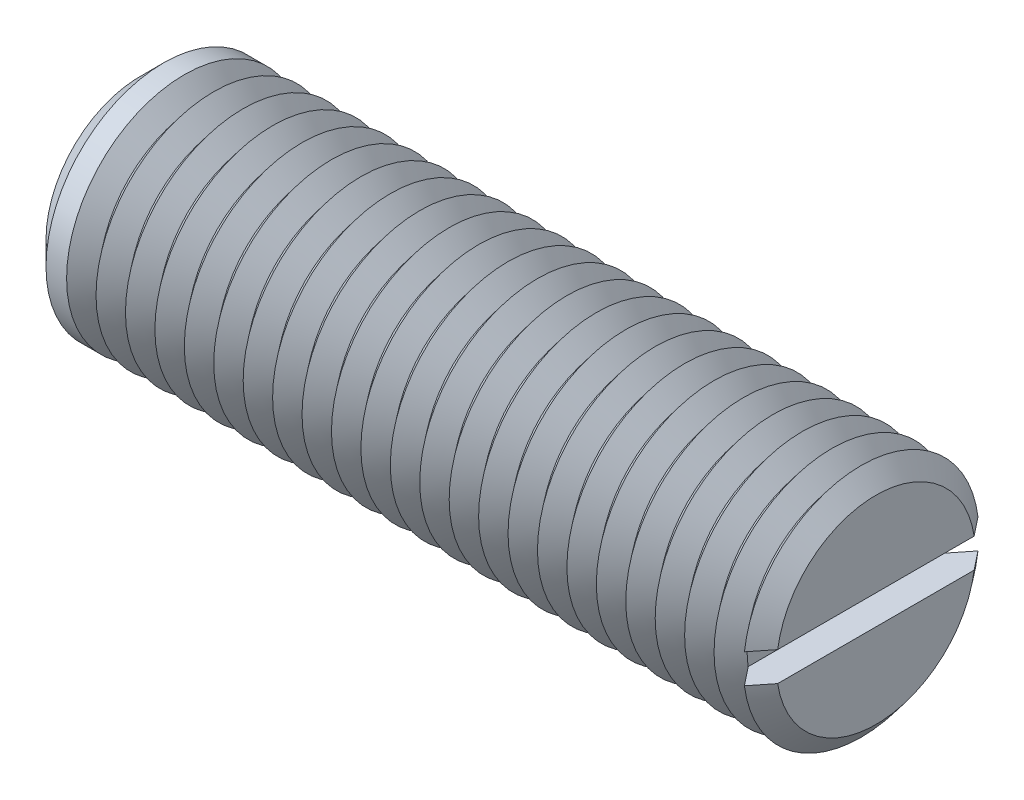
from build123d import *

# Parameters (mm, degrees)
SKETCH1_R       = 8
EXTRUDE1_DEPTH  = 25
SKETCH2_W       = 2
SKETCH2_H       = 2
EXTRUDE2_DEPTH  = 12
CHAMFER1_SIZE   = 1.6
LPATTERN1_COUNT = 24
LPATTERN1_PITCH = 2


with BuildPart() as part:
    # Sketch1 → Extrude1 (new, symmetric)
    with BuildSketch(Plane(origin=(0, 0, 0), x_dir=(0, 0, -1), z_dir=(1, 0, 0))):
        Circle(SKETCH1_R)
    extrude(amount=EXTRUDE1_DEPTH, both=True)

    # Sketch2 → Extrude2 (cut, symmetric)
    with BuildSketch(Plane.XY):
        with Locations((24, 0)):
            Rectangle(SKETCH2_W, SKETCH2_H)
    extrude(amount=EXTRUDE2_DEPTH, both=True, mode=Mode.SUBTRACT)

    # Chamfer1
    chamfer1_edges = [part.edges().sort_by_distance(p)[0] for p in [
        (-25, 0, 8),
    ]]
    chamfer(chamfer1_edges, length=CHAMFER1_SIZE)

    # Sketch3 → Cut-Revolve1 (revolve, cut)
    with BuildSketch(Plane.XY, mode=Mode.PRIVATE) as cut_revolve1_sk:
        Polygon((24, -8), (26, -8), (25, -6.7510004), align=None)
    cut_revolve1 = revolve(cut_revolve1_sk.sketch.rotate(Axis((0, 0, 0), (1, 0, 0)), 277.180755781), axis=Axis((0, 0, 0), (1, 0, 0)), mode=Mode.SUBTRACT)

    # LPattern1: Cut-Revolve1 ×24
    with Locations(*[(-i * LPATTERN1_PITCH, 0, 0) for i in range(1, LPATTERN1_COUNT)]):
        add(cut_revolve1, mode=Mode.SUBTRACT)


solid = part.part
